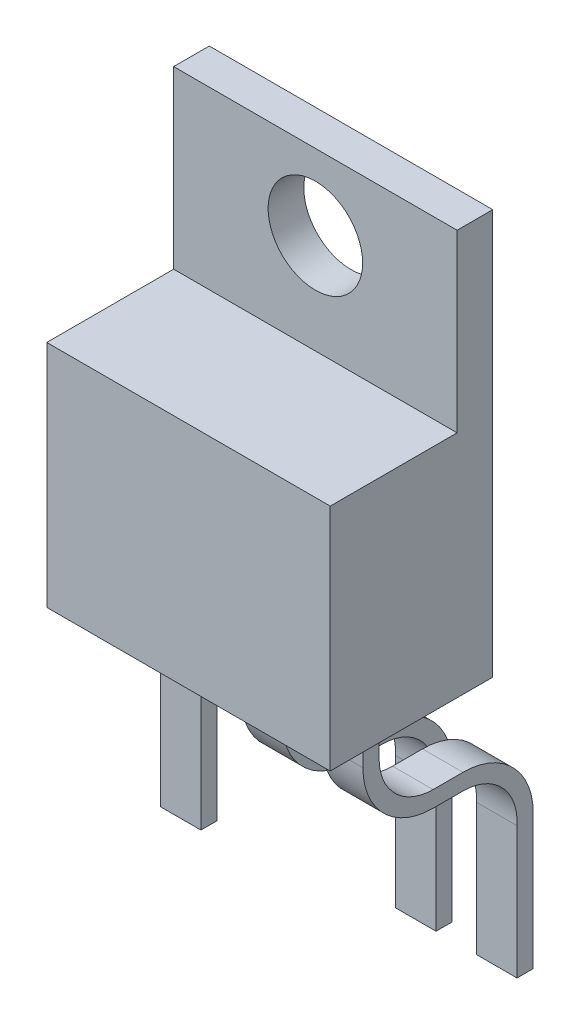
ISO-10303-21;
HEADER;
FILE_DESCRIPTION(('STEP AP214'),'2;1');
FILE_NAME('part.step','',(''),(''),'','','');
FILE_SCHEMA(('AUTOMOTIVE_DESIGN { 1 0 10303 214 1 1 1 1 }'));
ENDSEC;
DATA;
#1=APPLICATION_CONTEXT('core data for automotive mechanical design processes');
#2=APPLICATION_PROTOCOL_DEFINITION('international standard','automotive_design',2000,#1);
#3=PRODUCT_CONTEXT('',#1,'mechanical');
#4=PRODUCT('Part','Part','',(#3));
#5=PRODUCT_RELATED_PRODUCT_CATEGORY('part','',(#4));
#6=PRODUCT_DEFINITION_FORMATION('','',#4);
#7=PRODUCT_DEFINITION_CONTEXT('part definition',#1,'design');
#8=PRODUCT_DEFINITION('design','',#6,#7);
#9=PRODUCT_DEFINITION_SHAPE('','',#8);
#10=(LENGTH_UNIT() NAMED_UNIT(*) SI_UNIT(.MILLI.,.METRE.));
#11=(NAMED_UNIT(*) PLANE_ANGLE_UNIT() SI_UNIT($,.RADIAN.));
#12=(NAMED_UNIT(*) SI_UNIT($,.STERADIAN.) SOLID_ANGLE_UNIT());
#13=UNCERTAINTY_MEASURE_WITH_UNIT(LENGTH_MEASURE(1.E-05),#10,'distance_accuracy_value','');
#14=(GEOMETRIC_REPRESENTATION_CONTEXT(3) GLOBAL_UNCERTAINTY_ASSIGNED_CONTEXT((#13)) GLOBAL_UNIT_ASSIGNED_CONTEXT((#10,
#11,#12)) REPRESENTATION_CONTEXT('',''));
#15=CARTESIAN_POINT('',(0.,0.,0.));
#16=DIRECTION('',(0.,0.,1.));
#17=DIRECTION('',(1.,0.,0.));
#18=AXIS2_PLACEMENT_3D('',#15,#16,#17);
#19=CARTESIAN_POINT('',(0.,-2.,0.71));
#20=DIRECTION('',(1.,0.,0.));
#21=DIRECTION('',(0.,0.,-1.));
#22=AXIS2_PLACEMENT_3D('',#19,#20,#21);
#23=CYLINDRICAL_SURFACE('',#22,2.);
#24=CARTESIAN_POINT('',(4.5,-2.,0.71));
#25=DIRECTION('',(1.,0.,0.));
#26=DIRECTION('',(0.,1.,0.));
#27=AXIS2_PLACEMENT_3D('',#24,#25,#26);
#28=CIRCLE('',#27,2.);
#29=CARTESIAN_POINT('',(4.5,-2.,2.71));
#30=VERTEX_POINT('',#29);
#31=CARTESIAN_POINT('',(4.5,-4.,0.71));
#32=VERTEX_POINT('',#31);
#33=EDGE_CURVE('E302',#30,#32,#28,.T.);
#34=ORIENTED_EDGE('',*,*,#33,.F.);
#35=DIRECTION('',(1.,0.,0.));
#36=VECTOR('',#35,1.);
#37=CARTESIAN_POINT('',(0.,-2.,2.71));
#38=LINE('',#37,#36);
#39=CARTESIAN_POINT('',(6.,-2.,2.71));
#40=VERTEX_POINT('',#39);
#41=EDGE_CURVE('E449',#30,#40,#38,.T.);
#42=ORIENTED_EDGE('',*,*,#41,.T.);
#43=CARTESIAN_POINT('',(6.,-2.,0.71));
#44=DIRECTION('',(-1.,0.,0.));
#45=DIRECTION('',(0.,-1.,0.));
#46=AXIS2_PLACEMENT_3D('',#43,#44,#45);
#47=CIRCLE('',#46,2.);
#48=CARTESIAN_POINT('',(6.,-4.,0.71));
#49=VERTEX_POINT('',#48);
#50=EDGE_CURVE('E377',#49,#40,#47,.T.);
#51=ORIENTED_EDGE('',*,*,#50,.F.);
#52=DIRECTION('',(1.,0.,0.));
#53=VECTOR('',#52,1.);
#54=CARTESIAN_POINT('',(0.,-4.,0.71));
#55=LINE('',#54,#53);
#56=EDGE_CURVE('E399',#32,#49,#55,.T.);
#57=ORIENTED_EDGE('',*,*,#56,.F.);
#58=EDGE_LOOP('',(#34,#42,#51,#57));
#59=FACE_BOUND('',#58,.T.);
#60=ADVANCED_FACE('F37',(#59),#23,.F.);
#61=CARTESIAN_POINT('',(0.,-4.,0.71));
#62=DIRECTION('',(0.,1.,0.));
#63=DIRECTION('',(0.,0.,1.));
#64=AXIS2_PLACEMENT_3D('',#61,#62,#63);
#65=PLANE('',#64);
#66=DIRECTION('',(0.,0.,-1.));
#67=VECTOR('',#66,1.);
#68=CARTESIAN_POINT('',(4.5,-4.,0.71));
#69=LINE('',#68,#67);
#70=CARTESIAN_POINT('',(4.5,-4.,-0.4));
#71=VERTEX_POINT('',#70);
#72=EDGE_CURVE('E304',#32,#71,#69,.T.);
#73=ORIENTED_EDGE('',*,*,#72,.F.);
#74=ORIENTED_EDGE('',*,*,#56,.T.);
#75=DIRECTION('',(0.,0.,1.));
#76=VECTOR('',#75,1.);
#77=CARTESIAN_POINT('',(6.,-4.,0.71));
#78=LINE('',#77,#76);
#79=CARTESIAN_POINT('',(6.,-4.,-0.4));
#80=VERTEX_POINT('',#79);
#81=EDGE_CURVE('E380',#80,#49,#78,.T.);
#82=ORIENTED_EDGE('',*,*,#81,.F.);
#83=DIRECTION('',(1.,0.,0.));
#84=VECTOR('',#83,1.);
#85=CARTESIAN_POINT('',(0.,-4.,-0.4));
#86=LINE('',#85,#84);
#87=EDGE_CURVE('E403',#71,#80,#86,.T.);
#88=ORIENTED_EDGE('',*,*,#87,.F.);
#89=EDGE_LOOP('',(#73,#74,#82,#88));
#90=FACE_BOUND('',#89,.T.);
#91=ADVANCED_FACE('F675',(#90),#65,.T.);
#92=CARTESIAN_POINT('',(0.,-6.6,-0.4));
#93=DIRECTION('',(1.,0.,0.));
#94=DIRECTION('',(0.,0.,-1.));
#95=AXIS2_PLACEMENT_3D('',#92,#93,#94);
#96=CYLINDRICAL_SURFACE('',#95,2.6);
#97=CARTESIAN_POINT('',(4.5,-6.6,-0.4));
#98=DIRECTION('',(1.,0.,0.));
#99=DIRECTION('',(0.,1.,0.));
#100=AXIS2_PLACEMENT_3D('',#97,#98,#99);
#101=CIRCLE('',#100,2.6);
#102=CARTESIAN_POINT('',(4.5,-6.6,-3.));
#103=VERTEX_POINT('',#102);
#104=EDGE_CURVE('E306',#71,#103,#101,.F.);
#105=ORIENTED_EDGE('',*,*,#104,.F.);
#106=ORIENTED_EDGE('',*,*,#87,.T.);
#107=CARTESIAN_POINT('',(6.,-6.6,-0.4));
#108=DIRECTION('',(-1.,0.,0.));
#109=DIRECTION('',(0.,-1.,0.));
#110=AXIS2_PLACEMENT_3D('',#107,#108,#109);
#111=CIRCLE('',#110,2.6);
#112=CARTESIAN_POINT('',(6.,-6.6,-3.));
#113=VERTEX_POINT('',#112);
#114=EDGE_CURVE('E383',#113,#80,#111,.F.);
#115=ORIENTED_EDGE('',*,*,#114,.F.);
#116=DIRECTION('',(1.,0.,0.));
#117=VECTOR('',#116,1.);
#118=CARTESIAN_POINT('',(0.,-6.6,-3.));
#119=LINE('',#118,#117);
#120=EDGE_CURVE('E406',#103,#113,#119,.T.);
#121=ORIENTED_EDGE('',*,*,#120,.F.);
#122=EDGE_LOOP('',(#105,#106,#115,#121));
#123=FACE_BOUND('',#122,.T.);
#124=ADVANCED_FACE('F671',(#123),#96,.T.);
#125=CARTESIAN_POINT('',(0.,-6.6,-3.));
#126=DIRECTION('',(0.,0.,-1.));
#127=DIRECTION('',(0.,1.,0.));
#128=AXIS2_PLACEMENT_3D('',#125,#126,#127);
#129=PLANE('',#128);
#130=DIRECTION('',(0.,1.,0.));
#131=VECTOR('',#130,1.);
#132=CARTESIAN_POINT('',(4.5,0.,-3.));
#133=LINE('',#132,#131);
#134=CARTESIAN_POINT('',(4.5,-11.6,-3.));
#135=VERTEX_POINT('',#134);
#136=EDGE_CURVE('E288',#135,#103,#133,.T.);
#137=ORIENTED_EDGE('',*,*,#136,.T.);
#138=ORIENTED_EDGE('',*,*,#120,.T.);
#139=DIRECTION('',(0.,-1.,0.));
#140=VECTOR('',#139,1.);
#141=CARTESIAN_POINT('',(6.,0.,-3.));
#142=LINE('',#141,#140);
#143=CARTESIAN_POINT('',(6.,-11.6,-3.));
#144=VERTEX_POINT('',#143);
#145=EDGE_CURVE('E342',#113,#144,#142,.T.);
#146=ORIENTED_EDGE('',*,*,#145,.T.);
#147=DIRECTION('',(1.,0.,0.));
#148=VECTOR('',#147,1.);
#149=CARTESIAN_POINT('',(0.,-11.6,-3.));
#150=LINE('',#149,#148);
#151=EDGE_CURVE('E409',#135,#144,#150,.T.);
#152=ORIENTED_EDGE('',*,*,#151,.F.);
#153=EDGE_LOOP('',(#137,#138,#146,#152));
#154=FACE_BOUND('',#153,.T.);
#155=ADVANCED_FACE('F665',(#154),#129,.T.);
#156=CARTESIAN_POINT('',(0.,-11.6,-2.4));
#157=DIRECTION('',(0.,-1.,0.));
#158=DIRECTION('',(0.,0.,-1.));
#159=AXIS2_PLACEMENT_3D('',#156,#157,#158);
#160=PLANE('',#159);
#161=DIRECTION('',(0.,0.,1.));
#162=VECTOR('',#161,1.);
#163=CARTESIAN_POINT('',(4.5,-11.6,-3.));
#164=LINE('',#163,#162);
#165=CARTESIAN_POINT('',(4.5,-11.6,-2.4));
#166=VERTEX_POINT('',#165);
#167=EDGE_CURVE('E296',#135,#166,#164,.T.);
#168=ORIENTED_EDGE('',*,*,#167,.F.);
#169=ORIENTED_EDGE('',*,*,#151,.T.);
#170=DIRECTION('',(0.,0.,1.));
#171=VECTOR('',#170,1.);
#172=CARTESIAN_POINT('',(6.,-11.6,-3.));
#173=LINE('',#172,#171);
#174=CARTESIAN_POINT('',(6.,-11.6,-2.4));
#175=VERTEX_POINT('',#174);
#176=EDGE_CURVE('E349',#144,#175,#173,.T.);
#177=ORIENTED_EDGE('',*,*,#176,.T.);
#178=DIRECTION('',(1.,0.,0.));
#179=VECTOR('',#178,1.);
#180=CARTESIAN_POINT('',(0.,-11.6,-2.4));
#181=LINE('',#180,#179);
#182=EDGE_CURVE('E412',#166,#175,#181,.T.);
#183=ORIENTED_EDGE('',*,*,#182,.F.);
#184=EDGE_LOOP('',(#168,#169,#177,#183));
#185=FACE_BOUND('',#184,.T.);
#186=ADVANCED_FACE('F662',(#185),#160,.T.);
#187=CARTESIAN_POINT('',(0.,-6.71004182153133,-2.4));
#188=DIRECTION('',(0.,0.,1.));
#189=DIRECTION('',(0.,-1.,0.));
#190=AXIS2_PLACEMENT_3D('',#187,#188,#189);
#191=PLANE('',#190);
#192=DIRECTION('',(0.,1.,0.));
#193=VECTOR('',#192,1.);
#194=CARTESIAN_POINT('',(4.5,-6.71004182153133,-2.4));
#195=LINE('',#194,#193);
#196=CARTESIAN_POINT('',(4.5,-6.71004182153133,-2.4));
#197=VERTEX_POINT('',#196);
#198=EDGE_CURVE('E314',#166,#197,#195,.T.);
#199=ORIENTED_EDGE('',*,*,#198,.F.);
#200=ORIENTED_EDGE('',*,*,#182,.T.);
#201=DIRECTION('',(0.,-1.,0.));
#202=VECTOR('',#201,1.);
#203=CARTESIAN_POINT('',(6.,-6.71004182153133,-2.4));
#204=LINE('',#203,#202);
#205=CARTESIAN_POINT('',(6.,-6.71004182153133,-2.4));
#206=VERTEX_POINT('',#205);
#207=EDGE_CURVE('E395',#206,#175,#204,.T.);
#208=ORIENTED_EDGE('',*,*,#207,.F.);
#209=DIRECTION('',(1.,0.,0.));
#210=VECTOR('',#209,1.);
#211=CARTESIAN_POINT('',(0.,-6.71004182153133,-2.4));
#212=LINE('',#211,#210);
#213=EDGE_CURVE('E415',#197,#206,#212,.T.);
#214=ORIENTED_EDGE('',*,*,#213,.F.);
#215=EDGE_LOOP('',(#199,#200,#208,#214));
#216=FACE_BOUND('',#215,.T.);
#217=ADVANCED_FACE('F656',(#216),#191,.T.);
#218=CARTESIAN_POINT('',(0.,-6.60286942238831,-0.4));
#219=DIRECTION('',(1.,0.,0.));
#220=DIRECTION('',(0.,0.,-1.));
#221=AXIS2_PLACEMENT_3D('',#218,#219,#220);
#222=CYLINDRICAL_SURFACE('',#221,2.00286942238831);
#223=CARTESIAN_POINT('',(4.5,-6.60286942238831,-0.4));
#224=DIRECTION('',(1.,0.,0.));
#225=DIRECTION('',(0.,1.,0.));
#226=AXIS2_PLACEMENT_3D('',#223,#224,#225);
#227=CIRCLE('',#226,2.00286942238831);
#228=CARTESIAN_POINT('',(4.5,-4.6,-0.4));
#229=VERTEX_POINT('',#228);
#230=EDGE_CURVE('E312',#197,#229,#227,.T.);
#231=ORIENTED_EDGE('',*,*,#230,.F.);
#232=ORIENTED_EDGE('',*,*,#213,.T.);
#233=CARTESIAN_POINT('',(6.,-6.60286942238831,-0.4));
#234=DIRECTION('',(-1.,0.,0.));
#235=DIRECTION('',(0.,-1.,0.));
#236=AXIS2_PLACEMENT_3D('',#233,#234,#235);
#237=CIRCLE('',#236,2.00286942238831);
#238=CARTESIAN_POINT('',(6.,-4.6,-0.4));
#239=VERTEX_POINT('',#238);
#240=EDGE_CURVE('E392',#239,#206,#237,.T.);
#241=ORIENTED_EDGE('',*,*,#240,.F.);
#242=DIRECTION('',(1.,0.,0.));
#243=VECTOR('',#242,1.);
#244=CARTESIAN_POINT('',(0.,-4.6,-0.4));
#245=LINE('',#244,#243);
#246=EDGE_CURVE('E418',#229,#239,#245,.T.);
#247=ORIENTED_EDGE('',*,*,#246,.F.);
#248=EDGE_LOOP('',(#231,#232,#241,#247));
#249=FACE_BOUND('',#248,.T.);
#250=ADVANCED_FACE('F652',(#249),#222,.F.);
#251=CARTESIAN_POINT('',(0.,-4.6,0.709999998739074));
#252=DIRECTION('',(0.,-1.,0.));
#253=DIRECTION('',(0.,0.,-1.));
#254=AXIS2_PLACEMENT_3D('',#251,#252,#253);
#255=PLANE('',#254);
#256=DIRECTION('',(0.,0.,1.));
#257=VECTOR('',#256,1.);
#258=CARTESIAN_POINT('',(4.5,-4.6,0.709999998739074));
#259=LINE('',#258,#257);
#260=CARTESIAN_POINT('',(4.5,-4.6,0.709999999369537));
#261=VERTEX_POINT('',#260);
#262=EDGE_CURVE('E310',#229,#261,#259,.T.);
#263=ORIENTED_EDGE('',*,*,#262,.F.);
#264=ORIENTED_EDGE('',*,*,#246,.T.);
#265=DIRECTION('',(0.,0.,-1.));
#266=VECTOR('',#265,1.);
#267=CARTESIAN_POINT('',(6.,-4.6,0.709999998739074));
#268=LINE('',#267,#266);
#269=CARTESIAN_POINT('',(6.,-4.6,0.71));
#270=VERTEX_POINT('',#269);
#271=EDGE_CURVE('E389',#270,#239,#268,.T.);
#272=ORIENTED_EDGE('',*,*,#271,.F.);
#273=DIRECTION('',(1.,0.,0.));
#274=VECTOR('',#273,1.);
#275=CARTESIAN_POINT('',(0.,-4.6,0.709999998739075));
#276=LINE('',#275,#274);
#277=EDGE_CURVE('E421',#261,#270,#276,.T.);
#278=ORIENTED_EDGE('',*,*,#277,.F.);
#279=EDGE_LOOP('',(#263,#264,#272,#278));
#280=FACE_BOUND('',#279,.T.);
#281=ADVANCED_FACE('F646',(#280),#255,.T.);
#282=CARTESIAN_POINT('',(0.,-2.,0.71));
#283=DIRECTION('',(1.,0.,0.));
#284=DIRECTION('',(0.,0.,-1.));
#285=AXIS2_PLACEMENT_3D('',#282,#283,#284);
#286=CYLINDRICAL_SURFACE('',#285,2.6);
#287=CARTESIAN_POINT('',(4.5,-2.,0.71));
#288=DIRECTION('',(1.,0.,0.));
#289=DIRECTION('',(0.,1.,0.));
#290=AXIS2_PLACEMENT_3D('',#287,#288,#289);
#291=CIRCLE('',#290,2.6);
#292=CARTESIAN_POINT('',(4.5,-2.,3.31));
#293=VERTEX_POINT('',#292);
#294=EDGE_CURVE('E308',#261,#293,#291,.F.);
#295=ORIENTED_EDGE('',*,*,#294,.F.);
#296=ORIENTED_EDGE('',*,*,#277,.T.);
#297=CARTESIAN_POINT('',(6.,-2.,0.71));
#298=DIRECTION('',(-1.,0.,0.));
#299=DIRECTION('',(0.,-1.,0.));
#300=AXIS2_PLACEMENT_3D('',#297,#298,#299);
#301=CIRCLE('',#300,2.6);
#302=CARTESIAN_POINT('',(6.,-2.,3.31));
#303=VERTEX_POINT('',#302);
#304=EDGE_CURVE('E386',#303,#270,#301,.F.);
#305=ORIENTED_EDGE('',*,*,#304,.F.);
#306=DIRECTION('',(1.,0.,0.));
#307=VECTOR('',#306,1.);
#308=CARTESIAN_POINT('',(0.,-2.,3.31));
#309=LINE('',#308,#307);
#310=EDGE_CURVE('E424',#293,#303,#309,.T.);
#311=ORIENTED_EDGE('',*,*,#310,.F.);
#312=EDGE_LOOP('',(#295,#296,#305,#311));
#313=FACE_BOUND('',#312,.T.);
#314=ADVANCED_FACE('F642',(#313),#286,.T.);
#315=CARTESIAN_POINT('',(0.,-2.,3.31));
#316=DIRECTION('',(0.,0.,1.));
#317=DIRECTION('',(1.,0.,0.));
#318=AXIS2_PLACEMENT_3D('',#315,#316,#317);
#319=PLANE('',#318);
#320=DIRECTION('',(0.,1.,0.));
#321=VECTOR('',#320,1.);
#322=CARTESIAN_POINT('',(4.5,0.,3.31));
#323=LINE('',#322,#321);
#324=CARTESIAN_POINT('',(4.5,0.,3.31));
#325=VERTEX_POINT('',#324);
#326=EDGE_CURVE('E55',#293,#325,#323,.T.);
#327=ORIENTED_EDGE('',*,*,#326,.F.);
#328=ORIENTED_EDGE('',*,*,#310,.T.);
#329=DIRECTION('',(0.,-1.,0.));
#330=VECTOR('',#329,1.);
#331=CARTESIAN_POINT('',(6.,0.,3.31));
#332=LINE('',#331,#330);
#333=CARTESIAN_POINT('',(6.,0.,3.31));
#334=VERTEX_POINT('',#333);
#335=EDGE_CURVE('E341',#334,#303,#332,.T.);
#336=ORIENTED_EDGE('',*,*,#335,.F.);
#337=DIRECTION('',(1.,0.,0.));
#338=VECTOR('',#337,1.);
#339=CARTESIAN_POINT('',(0.,0.,3.31));
#340=LINE('',#339,#338);
#341=EDGE_CURVE('E41',#325,#334,#340,.T.);
#342=ORIENTED_EDGE('',*,*,#341,.F.);
#343=EDGE_LOOP('',(#327,#328,#336,#342));
#344=FACE_BOUND('',#343,.T.);
#345=ADVANCED_FACE('F636',(#344),#319,.T.);
#346=CARTESIAN_POINT('',(0.,-2.,2.71));
#347=DIRECTION('',(0.,0.,-1.));
#348=DIRECTION('',(-1.,0.,0.));
#349=AXIS2_PLACEMENT_3D('',#346,#347,#348);
#350=PLANE('',#349);
#351=DIRECTION('',(0.,-1.,0.));
#352=VECTOR('',#351,1.);
#353=CARTESIAN_POINT('',(4.5,-2.,2.71));
#354=LINE('',#353,#352);
#355=CARTESIAN_POINT('',(4.5,0.,2.71));
#356=VERTEX_POINT('',#355);
#357=EDGE_CURVE('E300',#356,#30,#354,.T.);
#358=ORIENTED_EDGE('',*,*,#357,.F.);
#359=DIRECTION('',(1.,0.,0.));
#360=VECTOR('',#359,1.);
#361=CARTESIAN_POINT('',(0.,0.,2.71));
#362=LINE('',#361,#360);
#363=CARTESIAN_POINT('',(6.,0.,2.71));
#364=VERTEX_POINT('',#363);
#365=EDGE_CURVE('E448',#356,#364,#362,.T.);
#366=ORIENTED_EDGE('',*,*,#365,.T.);
#367=DIRECTION('',(0.,1.,0.));
#368=VECTOR('',#367,1.);
#369=CARTESIAN_POINT('',(6.,-2.,2.71));
#370=LINE('',#369,#368);
#371=EDGE_CURVE('E47',#40,#364,#370,.T.);
#372=ORIENTED_EDGE('',*,*,#371,.F.);
#373=ORIENTED_EDGE('',*,*,#41,.F.);
#374=EDGE_LOOP('',(#358,#366,#372,#373));
#375=FACE_BOUND('',#374,.T.);
#376=ADVANCED_FACE('F629',(#375),#350,.T.);
#377=DIRECTION('',(0.,-1.,0.));
#378=VECTOR('',#377,1.);
#379=CARTESIAN_POINT('',(3.,0.,3.31));
#380=LINE('',#379,#378);
#381=CARTESIAN_POINT('',(3.,0.,3.31));
#382=VERTEX_POINT('',#381);
#383=CARTESIAN_POINT('',(3.,-7.,3.31));
#384=VERTEX_POINT('',#383);
#385=EDGE_CURVE('E287',#382,#384,#380,.T.);
#386=ORIENTED_EDGE('',*,*,#385,.F.);
#387=CARTESIAN_POINT('',(1.5,0.,3.31));
#388=VERTEX_POINT('',#387);
#389=EDGE_CURVE('E433',#388,#382,#340,.T.);
#390=ORIENTED_EDGE('',*,*,#389,.F.);
#391=DIRECTION('',(0.,1.,0.));
#392=VECTOR('',#391,1.);
#393=CARTESIAN_POINT('',(1.5,0.,3.31));
#394=LINE('',#393,#392);
#395=CARTESIAN_POINT('',(1.5,-7.,3.31));
#396=VERTEX_POINT('',#395);
#397=EDGE_CURVE('E63',#396,#388,#394,.T.);
#398=ORIENTED_EDGE('',*,*,#397,.F.);
#399=DIRECTION('',(-1.,0.,0.));
#400=VECTOR('',#399,1.);
#401=CARTESIAN_POINT('',(1.5,-7.,3.31));
#402=LINE('',#401,#400);
#403=EDGE_CURVE('E282',#384,#396,#402,.T.);
#404=ORIENTED_EDGE('',*,*,#403,.F.);
#405=EDGE_LOOP('',(#386,#390,#398,#404));
#406=FACE_BOUND('',#405,.T.);
#407=ADVANCED_FACE('F822',(#406),#319,.T.);
#408=DIRECTION('',(0.,1.,0.));
#409=VECTOR('',#408,1.);
#410=CARTESIAN_POINT('',(3.,-2.,2.71));
#411=LINE('',#410,#409);
#412=CARTESIAN_POINT('',(3.,-7.,2.71));
#413=VERTEX_POINT('',#412);
#414=CARTESIAN_POINT('',(3.,0.,2.71));
#415=VERTEX_POINT('',#414);
#416=EDGE_CURVE('E273',#413,#415,#411,.T.);
#417=ORIENTED_EDGE('',*,*,#416,.F.);
#418=DIRECTION('',(1.,0.,0.));
#419=VECTOR('',#418,1.);
#420=CARTESIAN_POINT('',(1.5,-7.,2.71));
#421=LINE('',#420,#419);
#422=CARTESIAN_POINT('',(1.5,-7.,2.71));
#423=VERTEX_POINT('',#422);
#424=EDGE_CURVE('E271',#423,#413,#421,.T.);
#425=ORIENTED_EDGE('',*,*,#424,.F.);
#426=DIRECTION('',(0.,-1.,0.));
#427=VECTOR('',#426,1.);
#428=CARTESIAN_POINT('',(1.5,-2.,2.71));
#429=LINE('',#428,#427);
#430=CARTESIAN_POINT('',(1.5,0.,2.71));
#431=VERTEX_POINT('',#430);
#432=EDGE_CURVE('E259',#431,#423,#429,.T.);
#433=ORIENTED_EDGE('',*,*,#432,.F.);
#434=EDGE_CURVE('E439',#431,#415,#362,.T.);
#435=ORIENTED_EDGE('',*,*,#434,.T.);
#436=EDGE_LOOP('',(#417,#425,#433,#435));
#437=FACE_BOUND('',#436,.T.);
#438=ADVANCED_FACE('F272',(#437),#350,.T.);
#439=CARTESIAN_POINT('',(0.,0.,1.32));
#440=DIRECTION('',(0.,0.,-1.));
#441=DIRECTION('',(-1.,0.,0.));
#442=AXIS2_PLACEMENT_3D('',#439,#440,#441);
#443=PLANE('',#442);
#444=CARTESIAN_POINT('',(5.25,12.2,1.32));
#445=DIRECTION('',(0.,0.,1.));
#446=DIRECTION('',(1.,0.,0.));
#447=AXIS2_PLACEMENT_3D('',#444,#445,#446);
#448=CIRCLE('',#447,1.75);
#449=CARTESIAN_POINT('',(7.,12.2,1.32));
#450=VERTEX_POINT('',#449);
#451=EDGE_CURVE('E479',#450,#450,#448,.T.);
#452=ORIENTED_EDGE('',*,*,#451,.F.);
#453=EDGE_LOOP('',(#452));
#454=FACE_BOUND('',#453,.T.);
#455=DIRECTION('',(-1.,0.,0.));
#456=VECTOR('',#455,1.);
#457=CARTESIAN_POINT('',(0.,8.5,1.32));
#458=LINE('',#457,#456);
#459=CARTESIAN_POINT('',(10.5,8.5,1.32));
#460=VERTEX_POINT('',#459);
#461=CARTESIAN_POINT('',(0.,8.5,1.32));
#462=VERTEX_POINT('',#461);
#463=EDGE_CURVE('E401',#460,#462,#458,.T.);
#464=ORIENTED_EDGE('',*,*,#463,.F.);
#465=DIRECTION('',(0.,1.,0.));
#466=VECTOR('',#465,1.);
#467=CARTESIAN_POINT('',(10.5,0.,1.32));
#468=LINE('',#467,#466);
#469=CARTESIAN_POINT('',(10.5,15.,1.32));
#470=VERTEX_POINT('',#469);
#471=EDGE_CURVE('E462',#460,#470,#468,.T.);
#472=ORIENTED_EDGE('',*,*,#471,.T.);
#473=DIRECTION('',(-1.,0.,0.));
#474=VECTOR('',#473,1.);
#475=CARTESIAN_POINT('',(0.,15.,1.32));
#476=LINE('',#475,#474);
#477=CARTESIAN_POINT('',(0.,15.,1.32));
#478=VERTEX_POINT('',#477);
#479=EDGE_CURVE('E472',#470,#478,#476,.T.);
#480=ORIENTED_EDGE('',*,*,#479,.T.);
#481=DIRECTION('',(0.,-1.,0.));
#482=VECTOR('',#481,1.);
#483=CARTESIAN_POINT('',(0.,0.,1.32));
#484=LINE('',#483,#482);
#485=EDGE_CURVE('E459',#478,#462,#484,.T.);
#486=ORIENTED_EDGE('',*,*,#485,.T.);
#487=EDGE_LOOP('',(#464,#472,#480,#486));
#488=FACE_BOUND('',#487,.T.);
#489=ADVANCED_FACE('F516',(#454,#488),#443,.F.);
#490=CARTESIAN_POINT('',(0.,0.,0.));
#491=DIRECTION('',(0.,0.,-1.));
#492=DIRECTION('',(-1.,0.,0.));
#493=AXIS2_PLACEMENT_3D('',#490,#491,#492);
#494=PLANE('',#493);
#495=DIRECTION('',(0.,-1.,0.));
#496=VECTOR('',#495,1.);
#497=CARTESIAN_POINT('',(0.,0.,0.));
#498=LINE('',#497,#496);
#499=CARTESIAN_POINT('',(0.,15.,0.));
#500=VERTEX_POINT('',#499);
#501=CARTESIAN_POINT('',(0.,0.,0.));
#502=VERTEX_POINT('',#501);
#503=EDGE_CURVE('E475',#500,#502,#498,.T.);
#504=ORIENTED_EDGE('',*,*,#503,.F.);
#505=DIRECTION('',(-1.,0.,0.));
#506=VECTOR('',#505,1.);
#507=CARTESIAN_POINT('',(0.,15.,0.));
#508=LINE('',#507,#506);
#509=CARTESIAN_POINT('',(10.5,15.,0.));
#510=VERTEX_POINT('',#509);
#511=EDGE_CURVE('E463',#510,#500,#508,.T.);
#512=ORIENTED_EDGE('',*,*,#511,.F.);
#513=DIRECTION('',(0.,1.,0.));
#514=VECTOR('',#513,1.);
#515=CARTESIAN_POINT('',(10.5,0.,0.));
#516=LINE('',#515,#514);
#517=CARTESIAN_POINT('',(10.5,0.,0.));
#518=VERTEX_POINT('',#517);
#519=EDGE_CURVE('E481',#518,#510,#516,.T.);
#520=ORIENTED_EDGE('',*,*,#519,.F.);
#521=DIRECTION('',(1.,0.,0.));
#522=VECTOR('',#521,1.);
#523=CARTESIAN_POINT('',(0.,0.,0.));
#524=LINE('',#523,#522);
#525=EDGE_CURVE('E478',#502,#518,#524,.T.);
#526=ORIENTED_EDGE('',*,*,#525,.F.);
#527=EDGE_LOOP('',(#504,#512,#520,#526));
#528=FACE_BOUND('',#527,.T.);
#529=CARTESIAN_POINT('',(5.25,12.2,0.));
#530=DIRECTION('',(0.,0.,1.));
#531=DIRECTION('',(1.,0.,0.));
#532=AXIS2_PLACEMENT_3D('',#529,#530,#531);
#533=CIRCLE('',#532,1.75);
#534=CARTESIAN_POINT('',(7.,12.2,0.));
#535=VERTEX_POINT('',#534);
#536=EDGE_CURVE('E468',#535,#535,#533,.T.);
#537=ORIENTED_EDGE('',*,*,#536,.T.);
#538=EDGE_LOOP('',(#537));
#539=FACE_BOUND('',#538,.T.);
#540=ADVANCED_FACE('F504',(#528,#539),#494,.T.);
#541=CARTESIAN_POINT('',(0.,0.,1.32));
#542=DIRECTION('',(1.,0.,0.));
#543=DIRECTION('',(0.,0.,-1.));
#544=AXIS2_PLACEMENT_3D('',#541,#542,#543);
#545=PLANE('',#544);
#546=ORIENTED_EDGE('',*,*,#503,.T.);
#547=DIRECTION('',(0.,0.,-1.));
#548=VECTOR('',#547,1.);
#549=CARTESIAN_POINT('',(0.,0.,1.32));
#550=LINE('',#549,#548);
#551=CARTESIAN_POINT('',(0.,0.,6.02));
#552=VERTEX_POINT('',#551);
#553=EDGE_CURVE('E444',#552,#502,#550,.T.);
#554=ORIENTED_EDGE('',*,*,#553,.F.);
#555=DIRECTION('',(0.,-1.,0.));
#556=VECTOR('',#555,1.);
#557=CARTESIAN_POINT('',(0.,0.,6.02));
#558=LINE('',#557,#556);
#559=CARTESIAN_POINT('',(0.,8.5,6.02));
#560=VERTEX_POINT('',#559);
#561=EDGE_CURVE('E523',#560,#552,#558,.T.);
#562=ORIENTED_EDGE('',*,*,#561,.F.);
#563=DIRECTION('',(0.,0.,-1.));
#564=VECTOR('',#563,1.);
#565=CARTESIAN_POINT('',(0.,8.5,6.02));
#566=LINE('',#565,#564);
#567=EDGE_CURVE('E513',#560,#462,#566,.T.);
#568=ORIENTED_EDGE('',*,*,#567,.T.);
#569=ORIENTED_EDGE('',*,*,#485,.F.);
#570=DIRECTION('',(0.,0.,-1.));
#571=VECTOR('',#570,1.);
#572=CARTESIAN_POINT('',(0.,15.,1.32));
#573=LINE('',#572,#571);
#574=EDGE_CURVE('E474',#478,#500,#573,.T.);
#575=ORIENTED_EDGE('',*,*,#574,.T.);
#576=EDGE_LOOP('',(#546,#554,#562,#568,#569,#575));
#577=FACE_BOUND('',#576,.T.);
#578=ADVANCED_FACE('F39',(#577),#545,.F.);
#579=CARTESIAN_POINT('',(0.,0.,1.32));
#580=DIRECTION('',(0.,1.,0.));
#581=DIRECTION('',(0.,0.,1.));
#582=AXIS2_PLACEMENT_3D('',#579,#580,#581);
#583=PLANE('',#582);
#584=ORIENTED_EDGE('',*,*,#365,.F.);
#585=DIRECTION('',(0.,0.,1.));
#586=VECTOR('',#585,1.);
#587=CARTESIAN_POINT('',(4.5,0.,-3.));
#588=LINE('',#587,#586);
#589=EDGE_CURVE('E294',#356,#325,#588,.T.);
#590=ORIENTED_EDGE('',*,*,#589,.T.);
#591=ORIENTED_EDGE('',*,*,#341,.T.);
#592=DIRECTION('',(0.,0.,1.));
#593=VECTOR('',#592,1.);
#594=CARTESIAN_POINT('',(6.,0.,-3.));
#595=LINE('',#594,#593);
#596=EDGE_CURVE('E354',#364,#334,#595,.T.);
#597=ORIENTED_EDGE('',*,*,#596,.F.);
#598=EDGE_LOOP('',(#584,#590,#591,#597));
#599=FACE_BOUND('',#598,.T.);
#600=ORIENTED_EDGE('',*,*,#525,.T.);
#601=DIRECTION('',(0.,0.,-1.));
#602=VECTOR('',#601,1.);
#603=CARTESIAN_POINT('',(10.5,0.,1.32));
#604=LINE('',#603,#602);
#605=CARTESIAN_POINT('',(10.5,0.,6.02));
#606=VERTEX_POINT('',#605);
#607=EDGE_CURVE('E452',#606,#518,#604,.T.);
#608=ORIENTED_EDGE('',*,*,#607,.F.);
#609=DIRECTION('',(1.,0.,0.));
#610=VECTOR('',#609,1.);
#611=CARTESIAN_POINT('',(0.,0.,6.02));
#612=LINE('',#611,#610);
#613=EDGE_CURVE('E525',#552,#606,#612,.T.);
#614=ORIENTED_EDGE('',*,*,#613,.F.);
#615=ORIENTED_EDGE('',*,*,#553,.T.);
#616=EDGE_LOOP('',(#600,#608,#614,#615));
#617=FACE_BOUND('',#616,.T.);
#618=DIRECTION('',(0.,0.,1.));
#619=VECTOR('',#618,1.);
#620=CARTESIAN_POINT('',(9.,0.,-3.));
#621=LINE('',#620,#619);
#622=CARTESIAN_POINT('',(8.99999999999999,0.,2.71));
#623=VERTEX_POINT('',#622);
#624=CARTESIAN_POINT('',(9.,0.,3.31));
#625=VERTEX_POINT('',#624);
#626=EDGE_CURVE('E323',#623,#625,#621,.T.);
#627=ORIENTED_EDGE('',*,*,#626,.F.);
#628=CARTESIAN_POINT('',(7.5,0.,2.71));
#629=VERTEX_POINT('',#628);
#630=EDGE_CURVE('E445',#629,#623,#362,.T.);
#631=ORIENTED_EDGE('',*,*,#630,.F.);
#632=DIRECTION('',(0.,0.,1.));
#633=VECTOR('',#632,1.);
#634=CARTESIAN_POINT('',(7.5,0.,-3.));
#635=LINE('',#634,#633);
#636=CARTESIAN_POINT('',(7.5,0.,3.31));
#637=VERTEX_POINT('',#636);
#638=EDGE_CURVE('E358',#629,#637,#635,.T.);
#639=ORIENTED_EDGE('',*,*,#638,.T.);
#640=EDGE_CURVE('E436',#637,#625,#340,.T.);
#641=ORIENTED_EDGE('',*,*,#640,.T.);
#642=EDGE_LOOP('',(#627,#631,#639,#641));
#643=FACE_BOUND('',#642,.T.);
#644=DIRECTION('',(0.,0.,1.));
#645=VECTOR('',#644,1.);
#646=CARTESIAN_POINT('',(3.,0.,-3.));
#647=LINE('',#646,#645);
#648=EDGE_CURVE('E291',#415,#382,#647,.T.);
#649=ORIENTED_EDGE('',*,*,#648,.F.);
#650=ORIENTED_EDGE('',*,*,#434,.F.);
#651=DIRECTION('',(0.,0.,1.));
#652=VECTOR('',#651,1.);
#653=CARTESIAN_POINT('',(1.5,0.,-3.));
#654=LINE('',#653,#652);
#655=EDGE_CURVE('E264',#431,#388,#654,.T.);
#656=ORIENTED_EDGE('',*,*,#655,.T.);
#657=ORIENTED_EDGE('',*,*,#389,.T.);
#658=EDGE_LOOP('',(#649,#650,#656,#657));
#659=FACE_BOUND('',#658,.T.);
#660=ADVANCED_FACE('F616',(#599,#617,#643,#659),#583,.F.);
#661=CARTESIAN_POINT('',(10.5,0.,1.32));
#662=DIRECTION('',(-1.,0.,0.));
#663=DIRECTION('',(0.,0.,1.));
#664=AXIS2_PLACEMENT_3D('',#661,#662,#663);
#665=PLANE('',#664);
#666=ORIENTED_EDGE('',*,*,#607,.T.);
#667=ORIENTED_EDGE('',*,*,#519,.T.);
#668=DIRECTION('',(0.,0.,-1.));
#669=VECTOR('',#668,1.);
#670=CARTESIAN_POINT('',(10.5,15.,1.32));
#671=LINE('',#670,#669);
#672=EDGE_CURVE('E485',#470,#510,#671,.T.);
#673=ORIENTED_EDGE('',*,*,#672,.F.);
#674=ORIENTED_EDGE('',*,*,#471,.F.);
#675=DIRECTION('',(0.,0.,-1.));
#676=VECTOR('',#675,1.);
#677=CARTESIAN_POINT('',(10.5,8.5,6.02));
#678=LINE('',#677,#676);
#679=CARTESIAN_POINT('',(10.5,8.5,6.02));
#680=VERTEX_POINT('',#679);
#681=EDGE_CURVE('E522',#680,#460,#678,.T.);
#682=ORIENTED_EDGE('',*,*,#681,.F.);
#683=DIRECTION('',(0.,1.,0.));
#684=VECTOR('',#683,1.);
#685=CARTESIAN_POINT('',(10.5,0.,6.02));
#686=LINE('',#685,#684);
#687=EDGE_CURVE('E497',#606,#680,#686,.T.);
#688=ORIENTED_EDGE('',*,*,#687,.F.);
#689=EDGE_LOOP('',(#666,#667,#673,#674,#682,#688));
#690=FACE_BOUND('',#689,.T.);
#691=ADVANCED_FACE('F495',(#690),#665,.F.);
#692=CARTESIAN_POINT('',(0.,15.,1.32));
#693=DIRECTION('',(0.,-1.,0.));
#694=DIRECTION('',(0.,0.,-1.));
#695=AXIS2_PLACEMENT_3D('',#692,#693,#694);
#696=PLANE('',#695);
#697=ORIENTED_EDGE('',*,*,#511,.T.);
#698=ORIENTED_EDGE('',*,*,#574,.F.);
#699=ORIENTED_EDGE('',*,*,#479,.F.);
#700=ORIENTED_EDGE('',*,*,#672,.T.);
#701=EDGE_LOOP('',(#697,#698,#699,#700));
#702=FACE_BOUND('',#701,.T.);
#703=ADVANCED_FACE('F507',(#702),#696,.F.);
#704=CARTESIAN_POINT('',(5.25,12.2,1.32));
#705=DIRECTION('',(0.,0.,-1.));
#706=DIRECTION('',(-1.,0.,0.));
#707=AXIS2_PLACEMENT_3D('',#704,#705,#706);
#708=CYLINDRICAL_SURFACE('',#707,1.75);
#709=ORIENTED_EDGE('',*,*,#451,.T.);
#710=EDGE_LOOP('',(#709));
#711=FACE_BOUND('',#710,.T.);
#712=ORIENTED_EDGE('',*,*,#536,.F.);
#713=EDGE_LOOP('',(#712));
#714=FACE_BOUND('',#713,.T.);
#715=ADVANCED_FACE('F705',(#711,#714),#708,.F.);
#716=CARTESIAN_POINT('',(0.,8.5,6.02));
#717=DIRECTION('',(0.,-1.,0.));
#718=DIRECTION('',(0.,0.,-1.));
#719=AXIS2_PLACEMENT_3D('',#716,#717,#718);
#720=PLANE('',#719);
#721=ORIENTED_EDGE('',*,*,#463,.T.);
#722=ORIENTED_EDGE('',*,*,#567,.F.);
#723=DIRECTION('',(-1.,0.,0.));
#724=VECTOR('',#723,1.);
#725=CARTESIAN_POINT('',(0.,8.5,6.02));
#726=LINE('',#725,#724);
#727=EDGE_CURVE('E532',#680,#560,#726,.T.);
#728=ORIENTED_EDGE('',*,*,#727,.F.);
#729=ORIENTED_EDGE('',*,*,#681,.T.);
#730=EDGE_LOOP('',(#721,#722,#728,#729));
#731=FACE_BOUND('',#730,.T.);
#732=ADVANCED_FACE('F520',(#731),#720,.F.);
#733=CARTESIAN_POINT('',(0.,0.,6.02));
#734=DIRECTION('',(0.,0.,-1.));
#735=DIRECTION('',(-1.,0.,0.));
#736=AXIS2_PLACEMENT_3D('',#733,#734,#735);
#737=PLANE('',#736);
#738=ORIENTED_EDGE('',*,*,#561,.T.);
#739=ORIENTED_EDGE('',*,*,#613,.T.);
#740=ORIENTED_EDGE('',*,*,#687,.T.);
#741=ORIENTED_EDGE('',*,*,#727,.T.);
#742=EDGE_LOOP('',(#738,#739,#740,#741));
#743=FACE_BOUND('',#742,.T.);
#744=ADVANCED_FACE('F697',(#743),#737,.F.);
#745=CARTESIAN_POINT('',(9.,-2.,0.71));
#746=DIRECTION('',(-1.,0.,0.));
#747=DIRECTION('',(0.,-1.,0.));
#748=AXIS2_PLACEMENT_3D('',#745,#746,#747);
#749=CIRCLE('',#748,2.);
#750=CARTESIAN_POINT('',(9.,-4.,0.71));
#751=VERTEX_POINT('',#750);
#752=CARTESIAN_POINT('',(9.,-2.,2.71));
#753=VERTEX_POINT('',#752);
#754=EDGE_CURVE('E325',#751,#753,#749,.T.);
#755=ORIENTED_EDGE('',*,*,#754,.F.);
#756=CARTESIAN_POINT('',(7.5,-4.,0.71));
#757=VERTEX_POINT('',#756);
#758=EDGE_CURVE('E402',#757,#751,#55,.T.);
#759=ORIENTED_EDGE('',*,*,#758,.F.);
#760=CARTESIAN_POINT('',(7.5,-2.,0.71));
#761=DIRECTION('',(1.,0.,0.));
#762=DIRECTION('',(0.,1.,0.));
#763=AXIS2_PLACEMENT_3D('',#760,#761,#762);
#764=CIRCLE('',#763,2.);
#765=CARTESIAN_POINT('',(7.5,-2.,2.71));
#766=VERTEX_POINT('',#765);
#767=EDGE_CURVE('E357',#766,#757,#764,.T.);
#768=ORIENTED_EDGE('',*,*,#767,.F.);
#769=EDGE_CURVE('E398',#766,#753,#38,.T.);
#770=ORIENTED_EDGE('',*,*,#769,.T.);
#771=EDGE_LOOP('',(#755,#759,#768,#770));
#772=FACE_BOUND('',#771,.T.);
#773=ADVANCED_FACE('F553',(#772),#23,.F.);
#774=DIRECTION('',(0.,0.,1.));
#775=VECTOR('',#774,1.);
#776=CARTESIAN_POINT('',(9.,-4.,0.71));
#777=LINE('',#776,#775);
#778=CARTESIAN_POINT('',(9.,-4.,-0.4));
#779=VERTEX_POINT('',#778);
#780=EDGE_CURVE('E329',#779,#751,#777,.T.);
#781=ORIENTED_EDGE('',*,*,#780,.F.);
#782=CARTESIAN_POINT('',(7.5,-4.,-0.4));
#783=VERTEX_POINT('',#782);
#784=EDGE_CURVE('E405',#783,#779,#86,.T.);
#785=ORIENTED_EDGE('',*,*,#784,.F.);
#786=DIRECTION('',(0.,0.,-1.));
#787=VECTOR('',#786,1.);
#788=CARTESIAN_POINT('',(7.5,-4.,0.71));
#789=LINE('',#788,#787);
#790=EDGE_CURVE('E365',#757,#783,#789,.T.);
#791=ORIENTED_EDGE('',*,*,#790,.F.);
#792=ORIENTED_EDGE('',*,*,#758,.T.);
#793=EDGE_LOOP('',(#781,#785,#791,#792));
#794=FACE_BOUND('',#793,.T.);
#795=ADVANCED_FACE('F569',(#794),#65,.T.);
#796=CARTESIAN_POINT('',(9.,-6.6,-0.4));
#797=DIRECTION('',(-1.,0.,0.));
#798=DIRECTION('',(0.,-1.,0.));
#799=AXIS2_PLACEMENT_3D('',#796,#797,#798);
#800=CIRCLE('',#799,2.6);
#801=CARTESIAN_POINT('',(9.,-6.6,-3.));
#802=VERTEX_POINT('',#801);
#803=EDGE_CURVE('E331',#802,#779,#800,.F.);
#804=ORIENTED_EDGE('',*,*,#803,.F.);
#805=CARTESIAN_POINT('',(7.5,-6.6,-3.));
#806=VERTEX_POINT('',#805);
#807=EDGE_CURVE('E408',#806,#802,#119,.T.);
#808=ORIENTED_EDGE('',*,*,#807,.F.);
#809=CARTESIAN_POINT('',(7.5,-6.6,-0.4));
#810=DIRECTION('',(1.,0.,0.));
#811=DIRECTION('',(0.,1.,0.));
#812=AXIS2_PLACEMENT_3D('',#809,#810,#811);
#813=CIRCLE('',#812,2.6);
#814=EDGE_CURVE('E367',#783,#806,#813,.F.);
#815=ORIENTED_EDGE('',*,*,#814,.F.);
#816=ORIENTED_EDGE('',*,*,#784,.T.);
#817=EDGE_LOOP('',(#804,#808,#815,#816));
#818=FACE_BOUND('',#817,.T.);
#819=ADVANCED_FACE('F573',(#818),#96,.T.);
#820=DIRECTION('',(0.,-1.,0.));
#821=VECTOR('',#820,1.);
#822=CARTESIAN_POINT('',(9.,0.,-3.));
#823=LINE('',#822,#821);
#824=CARTESIAN_POINT('',(9.,-11.6,-3.));
#825=VERTEX_POINT('',#824);
#826=EDGE_CURVE('E318',#802,#825,#823,.T.);
#827=ORIENTED_EDGE('',*,*,#826,.T.);
#828=CARTESIAN_POINT('',(7.5,-11.6,-3.));
#829=VERTEX_POINT('',#828);
#830=EDGE_CURVE('E411',#829,#825,#150,.T.);
#831=ORIENTED_EDGE('',*,*,#830,.F.);
#832=DIRECTION('',(0.,1.,0.));
#833=VECTOR('',#832,1.);
#834=CARTESIAN_POINT('',(7.5,0.,-3.));
#835=LINE('',#834,#833);
#836=EDGE_CURVE('E345',#829,#806,#835,.T.);
#837=ORIENTED_EDGE('',*,*,#836,.T.);
#838=ORIENTED_EDGE('',*,*,#807,.T.);
#839=EDGE_LOOP('',(#827,#831,#837,#838));
#840=FACE_BOUND('',#839,.T.);
#841=ADVANCED_FACE('F581',(#840),#129,.T.);
#842=DIRECTION('',(0.,0.,1.));
#843=VECTOR('',#842,1.);
#844=CARTESIAN_POINT('',(9.,-11.6,-3.));
#845=LINE('',#844,#843);
#846=CARTESIAN_POINT('',(9.,-11.6,-2.4));
#847=VERTEX_POINT('',#846);
#848=EDGE_CURVE('E321',#825,#847,#845,.T.);
#849=ORIENTED_EDGE('',*,*,#848,.T.);
#850=CARTESIAN_POINT('',(7.5,-11.6,-2.4));
#851=VERTEX_POINT('',#850);
#852=EDGE_CURVE('E414',#851,#847,#181,.T.);
#853=ORIENTED_EDGE('',*,*,#852,.F.);
#854=DIRECTION('',(0.,0.,1.));
#855=VECTOR('',#854,1.);
#856=CARTESIAN_POINT('',(7.5,-11.6,-3.));
#857=LINE('',#856,#855);
#858=EDGE_CURVE('E360',#829,#851,#857,.T.);
#859=ORIENTED_EDGE('',*,*,#858,.F.);
#860=ORIENTED_EDGE('',*,*,#830,.T.);
#861=EDGE_LOOP('',(#849,#853,#859,#860));
#862=FACE_BOUND('',#861,.T.);
#863=ADVANCED_FACE('F584',(#862),#160,.T.);
#864=DIRECTION('',(0.,-1.,0.));
#865=VECTOR('',#864,1.);
#866=CARTESIAN_POINT('',(9.,-6.71004182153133,-2.4));
#867=LINE('',#866,#865);
#868=CARTESIAN_POINT('',(9.,-6.71004182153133,-2.4));
#869=VERTEX_POINT('',#868);
#870=EDGE_CURVE('E339',#869,#847,#867,.T.);
#871=ORIENTED_EDGE('',*,*,#870,.F.);
#872=CARTESIAN_POINT('',(7.5,-6.71004182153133,-2.4));
#873=VERTEX_POINT('',#872);
#874=EDGE_CURVE('E417',#873,#869,#212,.T.);
#875=ORIENTED_EDGE('',*,*,#874,.F.);
#876=DIRECTION('',(0.,1.,0.));
#877=VECTOR('',#876,1.);
#878=CARTESIAN_POINT('',(7.5,-6.71004182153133,-2.4));
#879=LINE('',#878,#877);
#880=EDGE_CURVE('E375',#851,#873,#879,.T.);
#881=ORIENTED_EDGE('',*,*,#880,.F.);
#882=ORIENTED_EDGE('',*,*,#852,.T.);
#883=EDGE_LOOP('',(#871,#875,#881,#882));
#884=FACE_BOUND('',#883,.T.);
#885=ADVANCED_FACE('F592',(#884),#191,.T.);
#886=CARTESIAN_POINT('',(9.,-6.60286942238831,-0.4));
#887=DIRECTION('',(-1.,0.,0.));
#888=DIRECTION('',(0.,-1.,0.));
#889=AXIS2_PLACEMENT_3D('',#886,#887,#888);
#890=CIRCLE('',#889,2.00286942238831);
#891=CARTESIAN_POINT('',(9.,-4.6,-0.4));
#892=VERTEX_POINT('',#891);
#893=EDGE_CURVE('E337',#892,#869,#890,.T.);
#894=ORIENTED_EDGE('',*,*,#893,.F.);
#895=CARTESIAN_POINT('',(7.5,-4.6,-0.4));
#896=VERTEX_POINT('',#895);
#897=EDGE_CURVE('E420',#896,#892,#245,.T.);
#898=ORIENTED_EDGE('',*,*,#897,.F.);
#899=CARTESIAN_POINT('',(7.5,-6.60286942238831,-0.4));
#900=DIRECTION('',(1.,0.,0.));
#901=DIRECTION('',(0.,1.,0.));
#902=AXIS2_PLACEMENT_3D('',#899,#900,#901);
#903=CIRCLE('',#902,2.00286942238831);
#904=EDGE_CURVE('E373',#873,#896,#903,.T.);
#905=ORIENTED_EDGE('',*,*,#904,.F.);
#906=ORIENTED_EDGE('',*,*,#874,.T.);
#907=EDGE_LOOP('',(#894,#898,#905,#906));
#908=FACE_BOUND('',#907,.T.);
#909=ADVANCED_FACE('F596',(#908),#222,.F.);
#910=DIRECTION('',(0.,0.,-1.));
#911=VECTOR('',#910,1.);
#912=CARTESIAN_POINT('',(9.,-4.6,0.709999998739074));
#913=LINE('',#912,#911);
#914=CARTESIAN_POINT('',(9.,-4.6,0.71));
#915=VERTEX_POINT('',#914);
#916=EDGE_CURVE('E335',#915,#892,#913,.T.);
#917=ORIENTED_EDGE('',*,*,#916,.F.);
#918=CARTESIAN_POINT('',(7.5,-4.6,0.709999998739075));
#919=VERTEX_POINT('',#918);
#920=EDGE_CURVE('E423',#919,#915,#276,.T.);
#921=ORIENTED_EDGE('',*,*,#920,.F.);
#922=DIRECTION('',(0.,0.,1.));
#923=VECTOR('',#922,1.);
#924=CARTESIAN_POINT('',(7.5,-4.6,0.709999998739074));
#925=LINE('',#924,#923);
#926=EDGE_CURVE('E371',#896,#919,#925,.T.);
#927=ORIENTED_EDGE('',*,*,#926,.F.);
#928=ORIENTED_EDGE('',*,*,#897,.T.);
#929=EDGE_LOOP('',(#917,#921,#927,#928));
#930=FACE_BOUND('',#929,.T.);
#931=ADVANCED_FACE('F604',(#930),#255,.T.);
#932=CARTESIAN_POINT('',(9.,-2.,0.71));
#933=DIRECTION('',(-1.,0.,0.));
#934=DIRECTION('',(0.,-1.,0.));
#935=AXIS2_PLACEMENT_3D('',#932,#933,#934);
#936=CIRCLE('',#935,2.6);
#937=CARTESIAN_POINT('',(9.,-2.,3.31));
#938=VERTEX_POINT('',#937);
#939=EDGE_CURVE('E333',#938,#915,#936,.F.);
#940=ORIENTED_EDGE('',*,*,#939,.F.);
#941=CARTESIAN_POINT('',(7.5,-2.,3.31));
#942=VERTEX_POINT('',#941);
#943=EDGE_CURVE('E425',#942,#938,#309,.T.);
#944=ORIENTED_EDGE('',*,*,#943,.F.);
#945=CARTESIAN_POINT('',(7.5,-2.,0.71));
#946=DIRECTION('',(1.,0.,0.));
#947=DIRECTION('',(0.,1.,0.));
#948=AXIS2_PLACEMENT_3D('',#945,#946,#947);
#949=CIRCLE('',#948,2.6);
#950=EDGE_CURVE('E369',#919,#942,#949,.F.);
#951=ORIENTED_EDGE('',*,*,#950,.F.);
#952=ORIENTED_EDGE('',*,*,#920,.T.);
#953=EDGE_LOOP('',(#940,#944,#951,#952));
#954=FACE_BOUND('',#953,.T.);
#955=ADVANCED_FACE('F608',(#954),#286,.T.);
#956=DIRECTION('',(0.,-1.,0.));
#957=VECTOR('',#956,1.);
#958=CARTESIAN_POINT('',(9.,0.,3.31));
#959=LINE('',#958,#957);
#960=EDGE_CURVE('E268',#625,#938,#959,.T.);
#961=ORIENTED_EDGE('',*,*,#960,.F.);
#962=ORIENTED_EDGE('',*,*,#640,.F.);
#963=DIRECTION('',(0.,1.,0.));
#964=VECTOR('',#963,1.);
#965=CARTESIAN_POINT('',(7.5,0.,3.31));
#966=LINE('',#965,#964);
#967=EDGE_CURVE('E346',#942,#637,#966,.T.);
#968=ORIENTED_EDGE('',*,*,#967,.F.);
#969=ORIENTED_EDGE('',*,*,#943,.T.);
#970=EDGE_LOOP('',(#961,#962,#968,#969));
#971=FACE_BOUND('',#970,.T.);
#972=ADVANCED_FACE('F614',(#971),#319,.T.);
#973=DIRECTION('',(0.,1.,0.));
#974=VECTOR('',#973,1.);
#975=CARTESIAN_POINT('',(9.,-2.,2.71));
#976=LINE('',#975,#974);
#977=EDGE_CURVE('E11',#753,#623,#976,.T.);
#978=ORIENTED_EDGE('',*,*,#977,.F.);
#979=ORIENTED_EDGE('',*,*,#769,.F.);
#980=DIRECTION('',(0.,-1.,0.));
#981=VECTOR('',#980,1.);
#982=CARTESIAN_POINT('',(7.5,-2.,2.71));
#983=LINE('',#982,#981);
#984=EDGE_CURVE('E442',#629,#766,#983,.T.);
#985=ORIENTED_EDGE('',*,*,#984,.F.);
#986=ORIENTED_EDGE('',*,*,#630,.T.);
#987=EDGE_LOOP('',(#978,#979,#985,#986));
#988=FACE_BOUND('',#987,.T.);
#989=ADVANCED_FACE('F559',(#988),#350,.T.);
#990=CARTESIAN_POINT('',(6.,0.,-3.));
#991=DIRECTION('',(-1.,0.,0.));
#992=DIRECTION('',(0.,-1.,0.));
#993=AXIS2_PLACEMENT_3D('',#990,#991,#992);
#994=PLANE('',#993);
#995=ORIENTED_EDGE('',*,*,#207,.T.);
#996=ORIENTED_EDGE('',*,*,#176,.F.);
#997=ORIENTED_EDGE('',*,*,#145,.F.);
#998=ORIENTED_EDGE('',*,*,#114,.T.);
#999=ORIENTED_EDGE('',*,*,#81,.T.);
#1000=ORIENTED_EDGE('',*,*,#50,.T.);
#1001=ORIENTED_EDGE('',*,*,#371,.T.);
#1002=ORIENTED_EDGE('',*,*,#596,.T.);
#1003=ORIENTED_EDGE('',*,*,#335,.T.);
#1004=ORIENTED_EDGE('',*,*,#304,.T.);
#1005=ORIENTED_EDGE('',*,*,#271,.T.);
#1006=ORIENTED_EDGE('',*,*,#240,.T.);
#1007=EDGE_LOOP('',(#995,#996,#997,#998,#999,#1000,#1001,#1002,#1003,#1004,#1005,#1006));
#1008=FACE_BOUND('',#1007,.T.);
#1009=ADVANCED_FACE('F632',(#1008),#994,.F.);
#1010=CARTESIAN_POINT('',(7.5,0.,-3.));
#1011=DIRECTION('',(1.,0.,0.));
#1012=DIRECTION('',(0.,1.,0.));
#1013=AXIS2_PLACEMENT_3D('',#1010,#1011,#1012);
#1014=PLANE('',#1013);
#1015=ORIENTED_EDGE('',*,*,#880,.T.);
#1016=ORIENTED_EDGE('',*,*,#904,.T.);
#1017=ORIENTED_EDGE('',*,*,#926,.T.);
#1018=ORIENTED_EDGE('',*,*,#950,.T.);
#1019=ORIENTED_EDGE('',*,*,#967,.T.);
#1020=ORIENTED_EDGE('',*,*,#638,.F.);
#1021=ORIENTED_EDGE('',*,*,#984,.T.);
#1022=ORIENTED_EDGE('',*,*,#767,.T.);
#1023=ORIENTED_EDGE('',*,*,#790,.T.);
#1024=ORIENTED_EDGE('',*,*,#814,.T.);
#1025=ORIENTED_EDGE('',*,*,#836,.F.);
#1026=ORIENTED_EDGE('',*,*,#858,.T.);
#1027=EDGE_LOOP('',(#1015,#1016,#1017,#1018,#1019,#1020,#1021,#1022,#1023,#1024,#1025,#1026));
#1028=FACE_BOUND('',#1027,.T.);
#1029=ADVANCED_FACE('F577',(#1028),#1014,.F.);
#1030=CARTESIAN_POINT('',(9.,0.,-3.));
#1031=DIRECTION('',(-1.,0.,0.));
#1032=DIRECTION('',(0.,-1.,0.));
#1033=AXIS2_PLACEMENT_3D('',#1030,#1031,#1032);
#1034=PLANE('',#1033);
#1035=ORIENTED_EDGE('',*,*,#870,.T.);
#1036=ORIENTED_EDGE('',*,*,#848,.F.);
#1037=ORIENTED_EDGE('',*,*,#826,.F.);
#1038=ORIENTED_EDGE('',*,*,#803,.T.);
#1039=ORIENTED_EDGE('',*,*,#780,.T.);
#1040=ORIENTED_EDGE('',*,*,#754,.T.);
#1041=ORIENTED_EDGE('',*,*,#977,.T.);
#1042=ORIENTED_EDGE('',*,*,#626,.T.);
#1043=ORIENTED_EDGE('',*,*,#960,.T.);
#1044=ORIENTED_EDGE('',*,*,#939,.T.);
#1045=ORIENTED_EDGE('',*,*,#916,.T.);
#1046=ORIENTED_EDGE('',*,*,#893,.T.);
#1047=EDGE_LOOP('',(#1035,#1036,#1037,#1038,#1039,#1040,#1041,#1042,#1043,#1044,#1045,#1046));
#1048=FACE_BOUND('',#1047,.T.);
#1049=ADVANCED_FACE('F562',(#1048),#1034,.F.);
#1050=CARTESIAN_POINT('',(1.5,0.,-3.));
#1051=DIRECTION('',(1.,0.,0.));
#1052=DIRECTION('',(0.,1.,0.));
#1053=AXIS2_PLACEMENT_3D('',#1050,#1051,#1052);
#1054=PLANE('',#1053);
#1055=ORIENTED_EDGE('',*,*,#432,.T.);
#1056=DIRECTION('',(0.,0.,-1.));
#1057=VECTOR('',#1056,1.);
#1058=CARTESIAN_POINT('',(1.5,-7.,3.31));
#1059=LINE('',#1058,#1057);
#1060=EDGE_CURVE('E263',#396,#423,#1059,.T.);
#1061=ORIENTED_EDGE('',*,*,#1060,.F.);
#1062=ORIENTED_EDGE('',*,*,#397,.T.);
#1063=ORIENTED_EDGE('',*,*,#655,.F.);
#1064=EDGE_LOOP('',(#1055,#1061,#1062,#1063));
#1065=FACE_BOUND('',#1064,.T.);
#1066=ADVANCED_FACE('F261',(#1065),#1054,.F.);
#1067=CARTESIAN_POINT('',(4.5,0.,-3.));
#1068=DIRECTION('',(1.,0.,0.));
#1069=DIRECTION('',(0.,1.,0.));
#1070=AXIS2_PLACEMENT_3D('',#1067,#1068,#1069);
#1071=PLANE('',#1070);
#1072=ORIENTED_EDGE('',*,*,#198,.T.);
#1073=ORIENTED_EDGE('',*,*,#230,.T.);
#1074=ORIENTED_EDGE('',*,*,#262,.T.);
#1075=ORIENTED_EDGE('',*,*,#294,.T.);
#1076=ORIENTED_EDGE('',*,*,#326,.T.);
#1077=ORIENTED_EDGE('',*,*,#589,.F.);
#1078=ORIENTED_EDGE('',*,*,#357,.T.);
#1079=ORIENTED_EDGE('',*,*,#33,.T.);
#1080=ORIENTED_EDGE('',*,*,#72,.T.);
#1081=ORIENTED_EDGE('',*,*,#104,.T.);
#1082=ORIENTED_EDGE('',*,*,#136,.F.);
#1083=ORIENTED_EDGE('',*,*,#167,.T.);
#1084=EDGE_LOOP('',(#1072,#1073,#1074,#1075,#1076,#1077,#1078,#1079,#1080,#1081,#1082,#1083));
#1085=FACE_BOUND('',#1084,.T.);
#1086=ADVANCED_FACE('F677',(#1085),#1071,.F.);
#1087=CARTESIAN_POINT('',(3.,0.,-3.));
#1088=DIRECTION('',(-1.,0.,0.));
#1089=DIRECTION('',(0.,-1.,0.));
#1090=AXIS2_PLACEMENT_3D('',#1087,#1088,#1089);
#1091=PLANE('',#1090);
#1092=ORIENTED_EDGE('',*,*,#385,.T.);
#1093=DIRECTION('',(0.,0.,1.));
#1094=VECTOR('',#1093,1.);
#1095=CARTESIAN_POINT('',(3.,-7.,3.31));
#1096=LINE('',#1095,#1094);
#1097=EDGE_CURVE('E277',#413,#384,#1096,.T.);
#1098=ORIENTED_EDGE('',*,*,#1097,.F.);
#1099=ORIENTED_EDGE('',*,*,#416,.T.);
#1100=ORIENTED_EDGE('',*,*,#648,.T.);
#1101=EDGE_LOOP('',(#1092,#1098,#1099,#1100));
#1102=FACE_BOUND('',#1101,.T.);
#1103=ADVANCED_FACE('F679',(#1102),#1091,.F.);
#1104=CARTESIAN_POINT('',(0.,-7.,0.));
#1105=DIRECTION('',(0.,-1.,0.));
#1106=DIRECTION('',(1.,0.,0.));
#1107=AXIS2_PLACEMENT_3D('',#1104,#1105,#1106);
#1108=PLANE('',#1107);
#1109=ORIENTED_EDGE('',*,*,#1060,.T.);
#1110=ORIENTED_EDGE('',*,*,#424,.T.);
#1111=ORIENTED_EDGE('',*,*,#1097,.T.);
#1112=ORIENTED_EDGE('',*,*,#403,.T.);
#1113=EDGE_LOOP('',(#1109,#1110,#1111,#1112));
#1114=FACE_BOUND('',#1113,.T.);
#1115=ADVANCED_FACE('F280',(#1114),#1108,.T.);
#1116=CLOSED_SHELL('',(#60,#91,#124,#155,#186,#217,#250,#281,#314,#345,#376,#407,#438,#489,#540,
#578,#660,#691,#703,#715,#732,#744,#773,#795,#819,#841,#863,#885,#909,#931,#955,#972,#989,#1009,
#1029,#1049,#1066,#1086,#1103,#1115));
#1117=MANIFOLD_SOLID_BREP('B2',#1116);
#1118=ADVANCED_BREP_SHAPE_REPRESENTATION('',(#18,#1117),#14);
#1119=SHAPE_DEFINITION_REPRESENTATION(#9,#1118);
ENDSEC;
END-ISO-10303-21;
